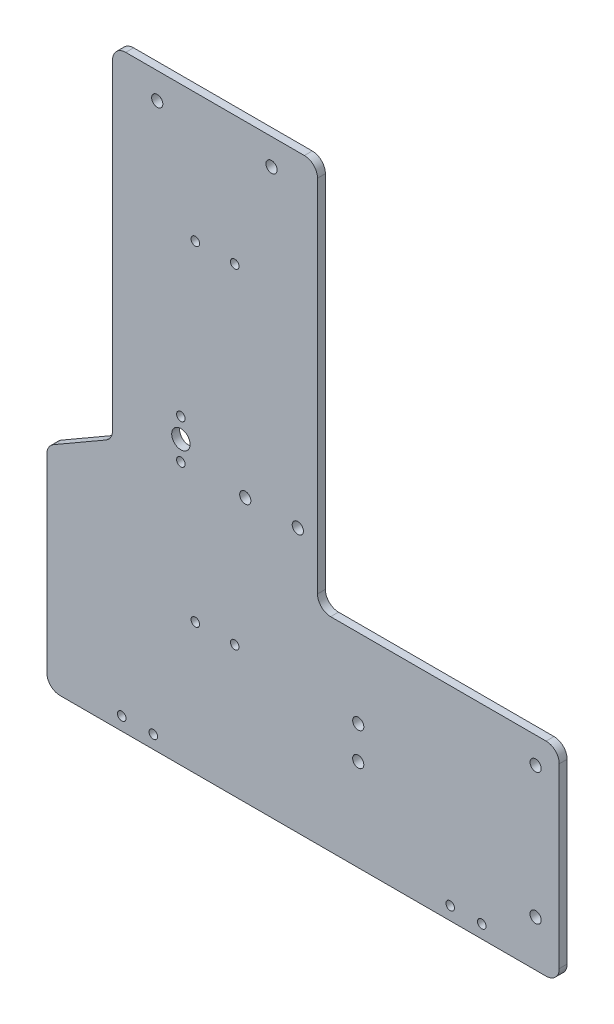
ISO-10303-21;
HEADER;
FILE_DESCRIPTION(('STEP AP214'),'2;1');
FILE_NAME('part.step','',(''),(''),'','','');
FILE_SCHEMA(('AUTOMOTIVE_DESIGN { 1 0 10303 214 1 1 1 1 }'));
ENDSEC;
DATA;
#1=APPLICATION_CONTEXT('core data for automotive mechanical design processes');
#2=APPLICATION_PROTOCOL_DEFINITION('international standard','automotive_design',2000,#1);
#3=PRODUCT_CONTEXT('',#1,'mechanical');
#4=PRODUCT('Part','Part','',(#3));
#5=PRODUCT_RELATED_PRODUCT_CATEGORY('part','',(#4));
#6=PRODUCT_DEFINITION_FORMATION('','',#4);
#7=PRODUCT_DEFINITION_CONTEXT('part definition',#1,'design');
#8=PRODUCT_DEFINITION('design','',#6,#7);
#9=PRODUCT_DEFINITION_SHAPE('','',#8);
#10=(LENGTH_UNIT() NAMED_UNIT(*) SI_UNIT(.MILLI.,.METRE.));
#11=(NAMED_UNIT(*) PLANE_ANGLE_UNIT() SI_UNIT($,.RADIAN.));
#12=(NAMED_UNIT(*) SI_UNIT($,.STERADIAN.) SOLID_ANGLE_UNIT());
#13=UNCERTAINTY_MEASURE_WITH_UNIT(LENGTH_MEASURE(1.E-05),#10,'distance_accuracy_value','');
#14=(GEOMETRIC_REPRESENTATION_CONTEXT(3) GLOBAL_UNCERTAINTY_ASSIGNED_CONTEXT((#13)) GLOBAL_UNIT_ASSIGNED_CONTEXT((#10,
#11,#12)) REPRESENTATION_CONTEXT('',''));
#15=CARTESIAN_POINT('',(0.,0.,0.));
#16=DIRECTION('',(0.,0.,1.));
#17=DIRECTION('',(1.,0.,0.));
#18=AXIS2_PLACEMENT_3D('',#15,#16,#17);
#19=CARTESIAN_POINT('',(-85.5227146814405,369.756925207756,6.00000000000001));
#20=DIRECTION('',(1.,0.,0.));
#21=DIRECTION('',(0.,1.,0.));
#22=AXIS2_PLACEMENT_3D('',#19,#20,#21);
#23=PLANE('',#22);
#24=DIRECTION('',(0.,-1.,0.));
#25=VECTOR('',#24,1.);
#26=CARTESIAN_POINT('',(-85.5227146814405,369.756925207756,6.00000000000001));
#27=LINE('',#26,#25);
#28=CARTESIAN_POINT('',(-85.5227146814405,74.9834225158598,6.00000000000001));
#29=VERTEX_POINT('',#28);
#30=CARTESIAN_POINT('',(-85.5227146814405,-69.2430747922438,6.00000000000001));
#31=VERTEX_POINT('',#30);
#32=EDGE_CURVE('E171',#29,#31,#27,.T.);
#33=ORIENTED_EDGE('',*,*,#32,.F.);
#34=DIRECTION('',(0.,0.,-1.));
#35=VECTOR('',#34,1.);
#36=CARTESIAN_POINT('',(-85.5227146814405,74.9834225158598,6.00000000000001));
#37=LINE('',#36,#35);
#38=CARTESIAN_POINT('',(-85.5227146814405,74.9834225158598,0.));
#39=VERTEX_POINT('',#38);
#40=EDGE_CURVE('E225',#29,#39,#37,.T.);
#41=ORIENTED_EDGE('',*,*,#40,.T.);
#42=DIRECTION('',(0.,-1.,0.));
#43=VECTOR('',#42,1.);
#44=CARTESIAN_POINT('',(-85.5227146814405,369.756925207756,0.));
#45=LINE('',#44,#43);
#46=CARTESIAN_POINT('',(-85.5227146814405,-69.2430747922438,0.));
#47=VERTEX_POINT('',#46);
#48=EDGE_CURVE('E173',#39,#47,#45,.T.);
#49=ORIENTED_EDGE('',*,*,#48,.T.);
#50=DIRECTION('',(0.,0.,-1.));
#51=VECTOR('',#50,1.);
#52=CARTESIAN_POINT('',(-85.5227146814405,-69.2430747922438,6.00000000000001));
#53=LINE('',#52,#51);
#54=EDGE_CURVE('E223',#47,#31,#53,.F.);
#55=ORIENTED_EDGE('',*,*,#54,.T.);
#56=EDGE_LOOP('',(#33,#41,#49,#55));
#57=FACE_BOUND('',#56,.T.);
#58=ADVANCED_FACE('F26',(#57),#23,.F.);
#59=CARTESIAN_POINT('',(-85.5227146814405,-79.2430747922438,6.00000000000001));
#60=DIRECTION('',(0.,1.,0.));
#61=DIRECTION('',(0.,0.,1.));
#62=AXIS2_PLACEMENT_3D('',#59,#60,#61);
#63=PLANE('',#62);
#64=DIRECTION('',(1.,0.,0.));
#65=VECTOR('',#64,1.);
#66=CARTESIAN_POINT('',(-85.5227146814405,-79.2430747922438,0.));
#67=LINE('',#66,#65);
#68=CARTESIAN_POINT('',(-75.5227146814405,-79.2430747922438,0.));
#69=VERTEX_POINT('',#68);
#70=CARTESIAN_POINT('',(294.47728531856,-79.2430747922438,0.));
#71=VERTEX_POINT('',#70);
#72=EDGE_CURVE('E168',#69,#71,#67,.T.);
#73=ORIENTED_EDGE('',*,*,#72,.T.);
#74=DIRECTION('',(0.,0.,-1.));
#75=VECTOR('',#74,1.);
#76=CARTESIAN_POINT('',(294.47728531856,-79.2430747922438,6.00000000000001));
#77=LINE('',#76,#75);
#78=CARTESIAN_POINT('',(294.47728531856,-79.2430747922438,6.00000000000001));
#79=VERTEX_POINT('',#78);
#80=EDGE_CURVE('E144',#71,#79,#77,.F.);
#81=ORIENTED_EDGE('',*,*,#80,.T.);
#82=DIRECTION('',(1.,0.,0.));
#83=VECTOR('',#82,1.);
#84=CARTESIAN_POINT('',(-85.5227146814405,-79.2430747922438,6.00000000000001));
#85=LINE('',#84,#83);
#86=CARTESIAN_POINT('',(-75.5227146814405,-79.2430747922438,6.00000000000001));
#87=VERTEX_POINT('',#86);
#88=EDGE_CURVE('E179',#87,#79,#85,.T.);
#89=ORIENTED_EDGE('',*,*,#88,.F.);
#90=DIRECTION('',(0.,0.,-1.));
#91=VECTOR('',#90,1.);
#92=CARTESIAN_POINT('',(-75.5227146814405,-79.2430747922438,6.00000000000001));
#93=LINE('',#92,#91);
#94=EDGE_CURVE('E149',#87,#69,#93,.T.);
#95=ORIENTED_EDGE('',*,*,#94,.T.);
#96=EDGE_LOOP('',(#73,#81,#89,#95));
#97=FACE_BOUND('',#96,.T.);
#98=ADVANCED_FACE('F453',(#97),#63,.F.);
#99=CARTESIAN_POINT('',(304.477285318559,369.756925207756,6.00000000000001));
#100=DIRECTION('',(-1.,0.,0.));
#101=DIRECTION('',(0.,-1.,0.));
#102=AXIS2_PLACEMENT_3D('',#99,#100,#101);
#103=PLANE('',#102);
#104=DIRECTION('',(0.,1.,0.));
#105=VECTOR('',#104,1.);
#106=CARTESIAN_POINT('',(304.477285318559,369.756925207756,6.00000000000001));
#107=LINE('',#106,#105);
#108=CARTESIAN_POINT('',(304.47728531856,-69.2430747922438,6.00000000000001));
#109=VERTEX_POINT('',#108);
#110=CARTESIAN_POINT('',(304.47728531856,65.7569252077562,6.00000000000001));
#111=VERTEX_POINT('',#110);
#112=EDGE_CURVE('E160',#109,#111,#107,.T.);
#113=ORIENTED_EDGE('',*,*,#112,.F.);
#114=DIRECTION('',(0.,0.,-1.));
#115=VECTOR('',#114,1.);
#116=CARTESIAN_POINT('',(304.47728531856,-69.2430747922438,6.00000000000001));
#117=LINE('',#116,#115);
#118=CARTESIAN_POINT('',(304.47728531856,-69.2430747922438,0.));
#119=VERTEX_POINT('',#118);
#120=EDGE_CURVE('E143',#109,#119,#117,.T.);
#121=ORIENTED_EDGE('',*,*,#120,.T.);
#122=DIRECTION('',(0.,1.,0.));
#123=VECTOR('',#122,1.);
#124=CARTESIAN_POINT('',(304.477285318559,369.756925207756,0.));
#125=LINE('',#124,#123);
#126=CARTESIAN_POINT('',(304.47728531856,65.7569252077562,0.));
#127=VERTEX_POINT('',#126);
#128=EDGE_CURVE('E157',#119,#127,#125,.T.);
#129=ORIENTED_EDGE('',*,*,#128,.T.);
#130=DIRECTION('',(0.,0.,1.));
#131=VECTOR('',#130,1.);
#132=CARTESIAN_POINT('',(304.47728531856,65.7569252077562,6.00000000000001));
#133=LINE('',#132,#131);
#134=EDGE_CURVE('E162',#127,#111,#133,.T.);
#135=ORIENTED_EDGE('',*,*,#134,.T.);
#136=EDGE_LOOP('',(#113,#121,#129,#135));
#137=FACE_BOUND('',#136,.T.);
#138=ADVANCED_FACE('F155',(#137),#103,.F.);
#139=CARTESIAN_POINT('',(-85.5227146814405,369.756925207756,6.00000000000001));
#140=DIRECTION('',(0.,-1.,0.));
#141=DIRECTION('',(0.,0.,-1.));
#142=AXIS2_PLACEMENT_3D('',#139,#140,#141);
#143=PLANE('',#142);
#144=DIRECTION('',(-1.,0.,0.));
#145=VECTOR('',#144,1.);
#146=CARTESIAN_POINT('',(-85.5227146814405,369.756925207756,6.00000000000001));
#147=LINE('',#146,#145);
#148=CARTESIAN_POINT('',(110.47728531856,369.756925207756,6.00000000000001));
#149=VERTEX_POINT('',#148);
#150=CARTESIAN_POINT('',(-25.5227146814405,369.756925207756,6.00000000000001));
#151=VERTEX_POINT('',#150);
#152=EDGE_CURVE('E183',#149,#151,#147,.T.);
#153=ORIENTED_EDGE('',*,*,#152,.F.);
#154=DIRECTION('',(0.,0.,1.));
#155=VECTOR('',#154,1.);
#156=CARTESIAN_POINT('',(110.47728531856,369.756925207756,6.00000000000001));
#157=LINE('',#156,#155);
#158=CARTESIAN_POINT('',(110.47728531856,369.756925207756,0.));
#159=VERTEX_POINT('',#158);
#160=EDGE_CURVE('E239',#149,#159,#157,.F.);
#161=ORIENTED_EDGE('',*,*,#160,.T.);
#162=DIRECTION('',(-1.,0.,0.));
#163=VECTOR('',#162,1.);
#164=CARTESIAN_POINT('',(-85.5227146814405,369.756925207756,0.));
#165=LINE('',#164,#163);
#166=CARTESIAN_POINT('',(-25.5227146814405,369.756925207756,0.));
#167=VERTEX_POINT('',#166);
#168=EDGE_CURVE('E167',#159,#167,#165,.T.);
#169=ORIENTED_EDGE('',*,*,#168,.T.);
#170=DIRECTION('',(0.,0.,1.));
#171=VECTOR('',#170,1.);
#172=CARTESIAN_POINT('',(-25.5227146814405,369.756925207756,6.00000000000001));
#173=LINE('',#172,#171);
#174=EDGE_CURVE('E237',#167,#151,#173,.T.);
#175=ORIENTED_EDGE('',*,*,#174,.T.);
#176=EDGE_LOOP('',(#153,#161,#169,#175));
#177=FACE_BOUND('',#176,.T.);
#178=ADVANCED_FACE('F397',(#177),#143,.F.);
#179=CARTESIAN_POINT('',(-85.5227146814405,-79.2430747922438,6.00000000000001));
#180=DIRECTION('',(0.,0.,1.));
#181=DIRECTION('',(1.,0.,0.));
#182=AXIS2_PLACEMENT_3D('',#179,#180,#181);
#183=PLANE('',#182);
#184=CARTESIAN_POINT('',(-28.5227146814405,-69.2430747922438,6.00000000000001));
#185=DIRECTION('',(0.,0.,1.));
#186=DIRECTION('',(1.,0.,0.));
#187=AXIS2_PLACEMENT_3D('',#184,#185,#186);
#188=CIRCLE('',#187,3.25);
#189=CARTESIAN_POINT('',(-25.2727146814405,-69.2430747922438,6.00000000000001));
#190=VERTEX_POINT('',#189);
#191=EDGE_CURVE('E389',#190,#190,#188,.T.);
#192=ORIENTED_EDGE('',*,*,#191,.F.);
#193=EDGE_LOOP('',(#192));
#194=FACE_BOUND('',#193,.T.);
#195=CARTESIAN_POINT('',(-4.5227146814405,-69.2430747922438,6.00000000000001));
#196=DIRECTION('',(0.,0.,1.));
#197=DIRECTION('',(1.,0.,0.));
#198=AXIS2_PLACEMENT_3D('',#195,#196,#197);
#199=CIRCLE('',#198,3.25);
#200=CARTESIAN_POINT('',(-1.27271468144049,-69.2430747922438,6.00000000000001));
#201=VERTEX_POINT('',#200);
#202=EDGE_CURVE('E383',#201,#201,#199,.T.);
#203=ORIENTED_EDGE('',*,*,#202,.F.);
#204=EDGE_LOOP('',(#203));
#205=FACE_BOUND('',#204,.T.);
#206=CARTESIAN_POINT('',(286.47728531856,55.7569252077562,6.00000000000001));
#207=DIRECTION('',(0.,0.,1.));
#208=DIRECTION('',(1.,0.,0.));
#209=AXIS2_PLACEMENT_3D('',#206,#207,#208);
#210=CIRCLE('',#209,4.24999999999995);
#211=CARTESIAN_POINT('',(290.727285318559,55.7569252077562,6.00000000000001));
#212=VERTEX_POINT('',#211);
#213=EDGE_CURVE('E377',#212,#212,#210,.T.);
#214=ORIENTED_EDGE('',*,*,#213,.F.);
#215=EDGE_LOOP('',(#214));
#216=FACE_BOUND('',#215,.T.);
#217=CARTESIAN_POINT('',(286.47728531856,-44.2430747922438,6.00000000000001));
#218=DIRECTION('',(0.,0.,1.));
#219=DIRECTION('',(1.,0.,0.));
#220=AXIS2_PLACEMENT_3D('',#217,#218,#219);
#221=CIRCLE('',#220,4.24999999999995);
#222=CARTESIAN_POINT('',(290.727285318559,-44.2430747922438,6.00000000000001));
#223=VERTEX_POINT('',#222);
#224=EDGE_CURVE('E371',#223,#223,#221,.T.);
#225=ORIENTED_EDGE('',*,*,#224,.F.);
#226=EDGE_LOOP('',(#225));
#227=FACE_BOUND('',#226,.T.);
#228=CARTESIAN_POINT('',(245.47728531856,-69.2430747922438,6.00000000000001));
#229=DIRECTION('',(0.,0.,1.));
#230=DIRECTION('',(1.,0.,0.));
#231=AXIS2_PLACEMENT_3D('',#228,#229,#230);
#232=CIRCLE('',#231,3.25000000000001);
#233=CARTESIAN_POINT('',(248.72728531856,-69.2430747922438,6.00000000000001));
#234=VERTEX_POINT('',#233);
#235=EDGE_CURVE('E365',#234,#234,#232,.T.);
#236=ORIENTED_EDGE('',*,*,#235,.F.);
#237=EDGE_LOOP('',(#236));
#238=FACE_BOUND('',#237,.T.);
#239=CARTESIAN_POINT('',(221.47728531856,-69.2430747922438,6.00000000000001));
#240=DIRECTION('',(0.,0.,1.));
#241=DIRECTION('',(1.,0.,0.));
#242=AXIS2_PLACEMENT_3D('',#239,#240,#241);
#243=CIRCLE('',#242,3.25000000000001);
#244=CARTESIAN_POINT('',(224.72728531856,-69.2430747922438,6.00000000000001));
#245=VERTEX_POINT('',#244);
#246=EDGE_CURVE('E359',#245,#245,#243,.T.);
#247=ORIENTED_EDGE('',*,*,#246,.F.);
#248=EDGE_LOOP('',(#247));
#249=FACE_BOUND('',#248,.T.);
#250=CARTESIAN_POINT('',(151.47728531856,-9.24307479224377,6.00000000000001));
#251=DIRECTION('',(0.,0.,1.));
#252=DIRECTION('',(1.,0.,0.));
#253=AXIS2_PLACEMENT_3D('',#250,#251,#252);
#254=CIRCLE('',#253,4.25000000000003);
#255=CARTESIAN_POINT('',(155.72728531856,-9.24307479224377,6.00000000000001));
#256=VERTEX_POINT('',#255);
#257=EDGE_CURVE('E353',#256,#256,#254,.T.);
#258=ORIENTED_EDGE('',*,*,#257,.F.);
#259=EDGE_LOOP('',(#258));
#260=FACE_BOUND('',#259,.T.);
#261=CARTESIAN_POINT('',(151.47728531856,15.7569252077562,6.00000000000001));
#262=DIRECTION('',(0.,0.,1.));
#263=DIRECTION('',(1.,0.,0.));
#264=AXIS2_PLACEMENT_3D('',#261,#262,#263);
#265=CIRCLE('',#264,4.25000000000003);
#266=CARTESIAN_POINT('',(155.72728531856,15.7569252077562,6.00000000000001));
#267=VERTEX_POINT('',#266);
#268=EDGE_CURVE('E347',#267,#267,#265,.T.);
#269=ORIENTED_EDGE('',*,*,#268,.F.);
#270=EDGE_LOOP('',(#269));
#271=FACE_BOUND('',#270,.T.);
#272=CARTESIAN_POINT('',(57.4772853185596,20.7569252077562,6.00000000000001));
#273=DIRECTION('',(0.,0.,1.));
#274=DIRECTION('',(1.,0.,0.));
#275=AXIS2_PLACEMENT_3D('',#272,#273,#274);
#276=CIRCLE('',#275,3.25);
#277=CARTESIAN_POINT('',(60.7272853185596,20.7569252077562,6.00000000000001));
#278=VERTEX_POINT('',#277);
#279=EDGE_CURVE('E341',#278,#278,#276,.T.);
#280=ORIENTED_EDGE('',*,*,#279,.F.);
#281=EDGE_LOOP('',(#280));
#282=FACE_BOUND('',#281,.T.);
#283=CARTESIAN_POINT('',(27.4772853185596,20.7569252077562,6.00000000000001));
#284=DIRECTION('',(0.,0.,1.));
#285=DIRECTION('',(1.,0.,0.));
#286=AXIS2_PLACEMENT_3D('',#283,#284,#285);
#287=CIRCLE('',#286,3.25);
#288=CARTESIAN_POINT('',(30.7272853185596,20.7569252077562,6.00000000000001));
#289=VERTEX_POINT('',#288);
#290=EDGE_CURVE('E335',#289,#289,#287,.T.);
#291=ORIENTED_EDGE('',*,*,#290,.F.);
#292=EDGE_LOOP('',(#291));
#293=FACE_BOUND('',#292,.T.);
#294=CARTESIAN_POINT('',(105.47728531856,121.756925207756,6.00000000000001));
#295=DIRECTION('',(0.,0.,1.));
#296=DIRECTION('',(1.,0.,0.));
#297=AXIS2_PLACEMENT_3D('',#294,#295,#296);
#298=CIRCLE('',#297,4.25000000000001);
#299=CARTESIAN_POINT('',(109.72728531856,121.756925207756,6.00000000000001));
#300=VERTEX_POINT('',#299);
#301=EDGE_CURVE('E329',#300,#300,#298,.T.);
#302=ORIENTED_EDGE('',*,*,#301,.F.);
#303=EDGE_LOOP('',(#302));
#304=FACE_BOUND('',#303,.T.);
#305=CARTESIAN_POINT('',(65.4772853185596,121.756925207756,6.00000000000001));
#306=DIRECTION('',(0.,0.,1.));
#307=DIRECTION('',(1.,0.,0.));
#308=AXIS2_PLACEMENT_3D('',#305,#306,#307);
#309=CIRCLE('',#308,4.25000000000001);
#310=CARTESIAN_POINT('',(69.7272853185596,121.756925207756,6.00000000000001));
#311=VERTEX_POINT('',#310);
#312=EDGE_CURVE('E323',#311,#311,#309,.T.);
#313=ORIENTED_EDGE('',*,*,#312,.F.);
#314=EDGE_LOOP('',(#313));
#315=FACE_BOUND('',#314,.T.);
#316=CARTESIAN_POINT('',(16.4772853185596,120.756925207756,6.00000000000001));
#317=DIRECTION('',(0.,0.,1.));
#318=DIRECTION('',(1.,0.,0.));
#319=AXIS2_PLACEMENT_3D('',#316,#317,#318);
#320=CIRCLE('',#319,3.25);
#321=CARTESIAN_POINT('',(19.7272853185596,120.756925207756,6.00000000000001));
#322=VERTEX_POINT('',#321);
#323=EDGE_CURVE('E317',#322,#322,#320,.T.);
#324=ORIENTED_EDGE('',*,*,#323,.F.);
#325=EDGE_LOOP('',(#324));
#326=FACE_BOUND('',#325,.T.);
#327=CARTESIAN_POINT('',(16.4772853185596,135.756925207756,6.00000000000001));
#328=DIRECTION('',(0.,0.,1.));
#329=DIRECTION('',(1.,0.,0.));
#330=AXIS2_PLACEMENT_3D('',#327,#328,#329);
#331=CIRCLE('',#330,7.00000000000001);
#332=CARTESIAN_POINT('',(23.4772853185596,135.756925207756,6.00000000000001));
#333=VERTEX_POINT('',#332);
#334=EDGE_CURVE('E311',#333,#333,#331,.T.);
#335=ORIENTED_EDGE('',*,*,#334,.F.);
#336=EDGE_LOOP('',(#335));
#337=FACE_BOUND('',#336,.T.);
#338=CARTESIAN_POINT('',(16.4772853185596,150.756925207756,6.00000000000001));
#339=DIRECTION('',(0.,0.,1.));
#340=DIRECTION('',(1.,0.,0.));
#341=AXIS2_PLACEMENT_3D('',#338,#339,#340);
#342=CIRCLE('',#341,3.25);
#343=CARTESIAN_POINT('',(19.7272853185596,150.756925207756,6.00000000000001));
#344=VERTEX_POINT('',#343);
#345=EDGE_CURVE('E305',#344,#344,#342,.T.);
#346=ORIENTED_EDGE('',*,*,#345,.F.);
#347=EDGE_LOOP('',(#346));
#348=FACE_BOUND('',#347,.T.);
#349=CARTESIAN_POINT('',(57.4772853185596,271.756925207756,6.00000000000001));
#350=DIRECTION('',(0.,0.,1.));
#351=DIRECTION('',(1.,0.,0.));
#352=AXIS2_PLACEMENT_3D('',#349,#350,#351);
#353=CIRCLE('',#352,3.25000000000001);
#354=CARTESIAN_POINT('',(60.7272853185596,271.756925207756,6.00000000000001));
#355=VERTEX_POINT('',#354);
#356=EDGE_CURVE('E299',#355,#355,#353,.T.);
#357=ORIENTED_EDGE('',*,*,#356,.F.);
#358=EDGE_LOOP('',(#357));
#359=FACE_BOUND('',#358,.T.);
#360=CARTESIAN_POINT('',(27.4772853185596,271.756925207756,6.00000000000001));
#361=DIRECTION('',(0.,0.,1.));
#362=DIRECTION('',(1.,0.,0.));
#363=AXIS2_PLACEMENT_3D('',#360,#361,#362);
#364=CIRCLE('',#363,3.25);
#365=CARTESIAN_POINT('',(30.7272853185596,271.756925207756,6.00000000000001));
#366=VERTEX_POINT('',#365);
#367=EDGE_CURVE('E293',#366,#366,#364,.T.);
#368=ORIENTED_EDGE('',*,*,#367,.F.);
#369=EDGE_LOOP('',(#368));
#370=FACE_BOUND('',#369,.T.);
#371=CARTESIAN_POINT('',(85.4772853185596,349.756925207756,6.00000000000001));
#372=DIRECTION('',(0.,0.,1.));
#373=DIRECTION('',(1.,0.,0.));
#374=AXIS2_PLACEMENT_3D('',#371,#372,#373);
#375=CIRCLE('',#374,4.25000000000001);
#376=CARTESIAN_POINT('',(89.7272853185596,349.756925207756,6.00000000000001));
#377=VERTEX_POINT('',#376);
#378=EDGE_CURVE('E287',#377,#377,#375,.T.);
#379=ORIENTED_EDGE('',*,*,#378,.F.);
#380=EDGE_LOOP('',(#379));
#381=FACE_BOUND('',#380,.T.);
#382=CARTESIAN_POINT('',(-1.52271468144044,349.756925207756,6.00000000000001));
#383=DIRECTION('',(0.,0.,1.));
#384=DIRECTION('',(1.,0.,0.));
#385=AXIS2_PLACEMENT_3D('',#382,#383,#384);
#386=CIRCLE('',#385,4.25);
#387=CARTESIAN_POINT('',(2.72728531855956,349.756925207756,6.00000000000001));
#388=VERTEX_POINT('',#387);
#389=EDGE_CURVE('E281',#388,#388,#386,.T.);
#390=ORIENTED_EDGE('',*,*,#389,.F.);
#391=EDGE_LOOP('',(#390));
#392=FACE_BOUND('',#391,.T.);
#393=ORIENTED_EDGE('',*,*,#88,.T.);
#394=CARTESIAN_POINT('',(294.47728531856,-69.2430747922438,6.00000000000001));
#395=DIRECTION('',(0.,0.,1.));
#396=DIRECTION('',(1.,0.,0.));
#397=AXIS2_PLACEMENT_3D('',#394,#395,#396);
#398=CIRCLE('',#397,10.);
#399=EDGE_CURVE('E211',#79,#109,#398,.T.);
#400=ORIENTED_EDGE('',*,*,#399,.T.);
#401=ORIENTED_EDGE('',*,*,#112,.T.);
#402=CARTESIAN_POINT('',(294.47728531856,65.7569252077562,6.00000000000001));
#403=DIRECTION('',(0.,0.,1.));
#404=DIRECTION('',(1.,0.,0.));
#405=AXIS2_PLACEMENT_3D('',#402,#403,#404);
#406=CIRCLE('',#405,10.);
#407=CARTESIAN_POINT('',(294.47728531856,75.7569252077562,6.00000000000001));
#408=VERTEX_POINT('',#407);
#409=EDGE_CURVE('E209',#111,#408,#406,.T.);
#410=ORIENTED_EDGE('',*,*,#409,.T.);
#411=DIRECTION('',(1.,0.,0.));
#412=VECTOR('',#411,1.);
#413=CARTESIAN_POINT('',(120.47728531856,75.7569252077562,6.00000000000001));
#414=LINE('',#413,#412);
#415=CARTESIAN_POINT('',(130.47728531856,75.7569252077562,6.00000000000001));
#416=VERTEX_POINT('',#415);
#417=EDGE_CURVE('E249',#416,#408,#414,.T.);
#418=ORIENTED_EDGE('',*,*,#417,.F.);
#419=CARTESIAN_POINT('',(130.47728531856,85.7569252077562,6.00000000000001));
#420=DIRECTION('',(0.,0.,1.));
#421=DIRECTION('',(1.,0.,0.));
#422=AXIS2_PLACEMENT_3D('',#419,#420,#421);
#423=CIRCLE('',#422,10.);
#424=CARTESIAN_POINT('',(120.47728531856,85.7569252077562,6.00000000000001));
#425=VERTEX_POINT('',#424);
#426=EDGE_CURVE('E33',#416,#425,#423,.F.);
#427=ORIENTED_EDGE('',*,*,#426,.T.);
#428=DIRECTION('',(0.,-1.,0.));
#429=VECTOR('',#428,1.);
#430=CARTESIAN_POINT('',(120.47728531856,369.756925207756,6.00000000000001));
#431=LINE('',#430,#429);
#432=CARTESIAN_POINT('',(120.47728531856,359.756925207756,6.00000000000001));
#433=VERTEX_POINT('',#432);
#434=EDGE_CURVE('E247',#433,#425,#431,.T.);
#435=ORIENTED_EDGE('',*,*,#434,.F.);
#436=CARTESIAN_POINT('',(110.47728531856,359.756925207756,6.00000000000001));
#437=DIRECTION('',(0.,0.,1.));
#438=DIRECTION('',(1.,0.,0.));
#439=AXIS2_PLACEMENT_3D('',#436,#437,#438);
#440=CIRCLE('',#439,10.);
#441=EDGE_CURVE('E48',#433,#149,#440,.T.);
#442=ORIENTED_EDGE('',*,*,#441,.T.);
#443=ORIENTED_EDGE('',*,*,#152,.T.);
#444=CARTESIAN_POINT('',(-25.5227146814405,359.756925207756,6.00000000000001));
#445=DIRECTION('',(0.,0.,1.));
#446=DIRECTION('',(1.,0.,0.));
#447=AXIS2_PLACEMENT_3D('',#444,#445,#446);
#448=CIRCLE('',#447,10.);
#449=CARTESIAN_POINT('',(-35.5227146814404,359.756925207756,6.00000000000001));
#450=VERTEX_POINT('',#449);
#451=EDGE_CURVE('E40',#151,#450,#448,.T.);
#452=ORIENTED_EDGE('',*,*,#451,.T.);
#453=DIRECTION('',(0.,1.,0.));
#454=VECTOR('',#453,1.);
#455=CARTESIAN_POINT('',(-35.5227146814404,369.756925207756,6.00000000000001));
#456=LINE('',#455,#454);
#457=CARTESIAN_POINT('',(-35.5227146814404,115.397941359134,6.00000000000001));
#458=VERTEX_POINT('',#457);
#459=EDGE_CURVE('E275',#458,#450,#456,.T.);
#460=ORIENTED_EDGE('',*,*,#459,.F.);
#461=CARTESIAN_POINT('',(-45.5227146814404,115.397941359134,6.00000000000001));
#462=DIRECTION('',(0.,0.,1.));
#463=DIRECTION('',(1.,0.,0.));
#464=AXIS2_PLACEMENT_3D('',#461,#462,#463);
#465=CIRCLE('',#464,10.);
#466=CARTESIAN_POINT('',(-40.5227146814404,106.73768732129,6.00000000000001));
#467=VERTEX_POINT('',#466);
#468=EDGE_CURVE('E241',#458,#467,#465,.F.);
#469=ORIENTED_EDGE('',*,*,#468,.T.);
#470=DIRECTION('',(0.866025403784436,0.500000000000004,0.));
#471=VECTOR('',#470,1.);
#472=CARTESIAN_POINT('',(-35.5227146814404,109.624438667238,6.00000000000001));
#473=LINE('',#472,#471);
#474=CARTESIAN_POINT('',(-80.5227146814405,83.6436765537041,6.00000000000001));
#475=VERTEX_POINT('',#474);
#476=EDGE_CURVE('E185',#467,#475,#473,.F.);
#477=ORIENTED_EDGE('',*,*,#476,.T.);
#478=CARTESIAN_POINT('',(-75.5227146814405,74.9834225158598,6.00000000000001));
#479=DIRECTION('',(0.,0.,1.));
#480=DIRECTION('',(1.,0.,0.));
#481=AXIS2_PLACEMENT_3D('',#478,#479,#480);
#482=CIRCLE('',#481,10.);
#483=EDGE_CURVE('E207',#475,#29,#482,.T.);
#484=ORIENTED_EDGE('',*,*,#483,.T.);
#485=ORIENTED_EDGE('',*,*,#32,.T.);
#486=CARTESIAN_POINT('',(-75.5227146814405,-69.2430747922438,6.00000000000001));
#487=DIRECTION('',(0.,0.,1.));
#488=DIRECTION('',(1.,0.,0.));
#489=AXIS2_PLACEMENT_3D('',#486,#487,#488);
#490=CIRCLE('',#489,10.);
#491=EDGE_CURVE('E203',#31,#87,#490,.T.);
#492=ORIENTED_EDGE('',*,*,#491,.T.);
#493=EDGE_LOOP('',(#393,#400,#401,#410,#418,#427,#435,#442,#443,#452,#460,#469,#477,#484,#485,#492));
#494=FACE_BOUND('',#493,.T.);
#495=ADVANCED_FACE('F246',(#194,#205,#216,#227,#238,#249,#260,#271,#282,#293,#304,#315,#326,
#337,#348,#359,#370,#381,#392,#494),#183,.T.);
#496=CARTESIAN_POINT('',(-85.5227146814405,-79.2430747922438,0.));
#497=DIRECTION('',(0.,0.,1.));
#498=DIRECTION('',(1.,0.,0.));
#499=AXIS2_PLACEMENT_3D('',#496,#497,#498);
#500=PLANE('',#499);
#501=CARTESIAN_POINT('',(-28.5227146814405,-69.2430747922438,0.));
#502=DIRECTION('',(0.,0.,1.));
#503=DIRECTION('',(1.,0.,0.));
#504=AXIS2_PLACEMENT_3D('',#501,#502,#503);
#505=CIRCLE('',#504,3.25);
#506=CARTESIAN_POINT('',(-25.2727146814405,-69.2430747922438,0.));
#507=VERTEX_POINT('',#506);
#508=EDGE_CURVE('E386',#507,#507,#505,.T.);
#509=ORIENTED_EDGE('',*,*,#508,.T.);
#510=EDGE_LOOP('',(#509));
#511=FACE_BOUND('',#510,.T.);
#512=CARTESIAN_POINT('',(-4.5227146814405,-69.2430747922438,0.));
#513=DIRECTION('',(0.,0.,1.));
#514=DIRECTION('',(1.,0.,0.));
#515=AXIS2_PLACEMENT_3D('',#512,#513,#514);
#516=CIRCLE('',#515,3.25);
#517=CARTESIAN_POINT('',(-1.27271468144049,-69.2430747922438,0.));
#518=VERTEX_POINT('',#517);
#519=EDGE_CURVE('E380',#518,#518,#516,.T.);
#520=ORIENTED_EDGE('',*,*,#519,.T.);
#521=EDGE_LOOP('',(#520));
#522=FACE_BOUND('',#521,.T.);
#523=CARTESIAN_POINT('',(286.47728531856,55.7569252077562,0.));
#524=DIRECTION('',(0.,0.,1.));
#525=DIRECTION('',(1.,0.,0.));
#526=AXIS2_PLACEMENT_3D('',#523,#524,#525);
#527=CIRCLE('',#526,4.24999999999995);
#528=CARTESIAN_POINT('',(290.727285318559,55.7569252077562,0.));
#529=VERTEX_POINT('',#528);
#530=EDGE_CURVE('E374',#529,#529,#527,.T.);
#531=ORIENTED_EDGE('',*,*,#530,.T.);
#532=EDGE_LOOP('',(#531));
#533=FACE_BOUND('',#532,.T.);
#534=CARTESIAN_POINT('',(286.47728531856,-44.2430747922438,0.));
#535=DIRECTION('',(0.,0.,1.));
#536=DIRECTION('',(1.,0.,0.));
#537=AXIS2_PLACEMENT_3D('',#534,#535,#536);
#538=CIRCLE('',#537,4.24999999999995);
#539=CARTESIAN_POINT('',(290.727285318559,-44.2430747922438,0.));
#540=VERTEX_POINT('',#539);
#541=EDGE_CURVE('E368',#540,#540,#538,.T.);
#542=ORIENTED_EDGE('',*,*,#541,.T.);
#543=EDGE_LOOP('',(#542));
#544=FACE_BOUND('',#543,.T.);
#545=CARTESIAN_POINT('',(245.47728531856,-69.2430747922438,0.));
#546=DIRECTION('',(0.,0.,1.));
#547=DIRECTION('',(1.,0.,0.));
#548=AXIS2_PLACEMENT_3D('',#545,#546,#547);
#549=CIRCLE('',#548,3.25000000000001);
#550=CARTESIAN_POINT('',(248.72728531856,-69.2430747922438,0.));
#551=VERTEX_POINT('',#550);
#552=EDGE_CURVE('E362',#551,#551,#549,.T.);
#553=ORIENTED_EDGE('',*,*,#552,.T.);
#554=EDGE_LOOP('',(#553));
#555=FACE_BOUND('',#554,.T.);
#556=CARTESIAN_POINT('',(221.47728531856,-69.2430747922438,0.));
#557=DIRECTION('',(0.,0.,1.));
#558=DIRECTION('',(1.,0.,0.));
#559=AXIS2_PLACEMENT_3D('',#556,#557,#558);
#560=CIRCLE('',#559,3.25000000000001);
#561=CARTESIAN_POINT('',(224.72728531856,-69.2430747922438,0.));
#562=VERTEX_POINT('',#561);
#563=EDGE_CURVE('E356',#562,#562,#560,.T.);
#564=ORIENTED_EDGE('',*,*,#563,.T.);
#565=EDGE_LOOP('',(#564));
#566=FACE_BOUND('',#565,.T.);
#567=CARTESIAN_POINT('',(151.47728531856,-9.24307479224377,0.));
#568=DIRECTION('',(0.,0.,1.));
#569=DIRECTION('',(1.,0.,0.));
#570=AXIS2_PLACEMENT_3D('',#567,#568,#569);
#571=CIRCLE('',#570,4.25000000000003);
#572=CARTESIAN_POINT('',(155.72728531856,-9.24307479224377,0.));
#573=VERTEX_POINT('',#572);
#574=EDGE_CURVE('E350',#573,#573,#571,.T.);
#575=ORIENTED_EDGE('',*,*,#574,.T.);
#576=EDGE_LOOP('',(#575));
#577=FACE_BOUND('',#576,.T.);
#578=CARTESIAN_POINT('',(151.47728531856,15.7569252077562,0.));
#579=DIRECTION('',(0.,0.,1.));
#580=DIRECTION('',(1.,0.,0.));
#581=AXIS2_PLACEMENT_3D('',#578,#579,#580);
#582=CIRCLE('',#581,4.25000000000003);
#583=CARTESIAN_POINT('',(155.72728531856,15.7569252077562,0.));
#584=VERTEX_POINT('',#583);
#585=EDGE_CURVE('E344',#584,#584,#582,.T.);
#586=ORIENTED_EDGE('',*,*,#585,.T.);
#587=EDGE_LOOP('',(#586));
#588=FACE_BOUND('',#587,.T.);
#589=CARTESIAN_POINT('',(57.4772853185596,20.7569252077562,0.));
#590=DIRECTION('',(0.,0.,1.));
#591=DIRECTION('',(1.,0.,0.));
#592=AXIS2_PLACEMENT_3D('',#589,#590,#591);
#593=CIRCLE('',#592,3.25);
#594=CARTESIAN_POINT('',(60.7272853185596,20.7569252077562,0.));
#595=VERTEX_POINT('',#594);
#596=EDGE_CURVE('E338',#595,#595,#593,.T.);
#597=ORIENTED_EDGE('',*,*,#596,.T.);
#598=EDGE_LOOP('',(#597));
#599=FACE_BOUND('',#598,.T.);
#600=CARTESIAN_POINT('',(27.4772853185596,20.7569252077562,0.));
#601=DIRECTION('',(0.,0.,1.));
#602=DIRECTION('',(1.,0.,0.));
#603=AXIS2_PLACEMENT_3D('',#600,#601,#602);
#604=CIRCLE('',#603,3.25);
#605=CARTESIAN_POINT('',(30.7272853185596,20.7569252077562,0.));
#606=VERTEX_POINT('',#605);
#607=EDGE_CURVE('E332',#606,#606,#604,.T.);
#608=ORIENTED_EDGE('',*,*,#607,.T.);
#609=EDGE_LOOP('',(#608));
#610=FACE_BOUND('',#609,.T.);
#611=CARTESIAN_POINT('',(105.47728531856,121.756925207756,0.));
#612=DIRECTION('',(0.,0.,1.));
#613=DIRECTION('',(1.,0.,0.));
#614=AXIS2_PLACEMENT_3D('',#611,#612,#613);
#615=CIRCLE('',#614,4.25000000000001);
#616=CARTESIAN_POINT('',(109.72728531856,121.756925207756,0.));
#617=VERTEX_POINT('',#616);
#618=EDGE_CURVE('E326',#617,#617,#615,.T.);
#619=ORIENTED_EDGE('',*,*,#618,.T.);
#620=EDGE_LOOP('',(#619));
#621=FACE_BOUND('',#620,.T.);
#622=CARTESIAN_POINT('',(65.4772853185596,121.756925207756,0.));
#623=DIRECTION('',(0.,0.,1.));
#624=DIRECTION('',(1.,0.,0.));
#625=AXIS2_PLACEMENT_3D('',#622,#623,#624);
#626=CIRCLE('',#625,4.25000000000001);
#627=CARTESIAN_POINT('',(69.7272853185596,121.756925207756,0.));
#628=VERTEX_POINT('',#627);
#629=EDGE_CURVE('E320',#628,#628,#626,.T.);
#630=ORIENTED_EDGE('',*,*,#629,.T.);
#631=EDGE_LOOP('',(#630));
#632=FACE_BOUND('',#631,.T.);
#633=CARTESIAN_POINT('',(16.4772853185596,120.756925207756,0.));
#634=DIRECTION('',(0.,0.,1.));
#635=DIRECTION('',(1.,0.,0.));
#636=AXIS2_PLACEMENT_3D('',#633,#634,#635);
#637=CIRCLE('',#636,3.25);
#638=CARTESIAN_POINT('',(19.7272853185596,120.756925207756,0.));
#639=VERTEX_POINT('',#638);
#640=EDGE_CURVE('E314',#639,#639,#637,.T.);
#641=ORIENTED_EDGE('',*,*,#640,.T.);
#642=EDGE_LOOP('',(#641));
#643=FACE_BOUND('',#642,.T.);
#644=CARTESIAN_POINT('',(16.4772853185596,135.756925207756,0.));
#645=DIRECTION('',(0.,0.,1.));
#646=DIRECTION('',(1.,0.,0.));
#647=AXIS2_PLACEMENT_3D('',#644,#645,#646);
#648=CIRCLE('',#647,7.00000000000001);
#649=CARTESIAN_POINT('',(23.4772853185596,135.756925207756,0.));
#650=VERTEX_POINT('',#649);
#651=EDGE_CURVE('E308',#650,#650,#648,.T.);
#652=ORIENTED_EDGE('',*,*,#651,.T.);
#653=EDGE_LOOP('',(#652));
#654=FACE_BOUND('',#653,.T.);
#655=CARTESIAN_POINT('',(16.4772853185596,150.756925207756,0.));
#656=DIRECTION('',(0.,0.,1.));
#657=DIRECTION('',(1.,0.,0.));
#658=AXIS2_PLACEMENT_3D('',#655,#656,#657);
#659=CIRCLE('',#658,3.25);
#660=CARTESIAN_POINT('',(19.7272853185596,150.756925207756,0.));
#661=VERTEX_POINT('',#660);
#662=EDGE_CURVE('E302',#661,#661,#659,.T.);
#663=ORIENTED_EDGE('',*,*,#662,.T.);
#664=EDGE_LOOP('',(#663));
#665=FACE_BOUND('',#664,.T.);
#666=CARTESIAN_POINT('',(57.4772853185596,271.756925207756,0.));
#667=DIRECTION('',(0.,0.,1.));
#668=DIRECTION('',(1.,0.,0.));
#669=AXIS2_PLACEMENT_3D('',#666,#667,#668);
#670=CIRCLE('',#669,3.25000000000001);
#671=CARTESIAN_POINT('',(60.7272853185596,271.756925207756,0.));
#672=VERTEX_POINT('',#671);
#673=EDGE_CURVE('E296',#672,#672,#670,.T.);
#674=ORIENTED_EDGE('',*,*,#673,.T.);
#675=EDGE_LOOP('',(#674));
#676=FACE_BOUND('',#675,.T.);
#677=CARTESIAN_POINT('',(27.4772853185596,271.756925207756,0.));
#678=DIRECTION('',(0.,0.,1.));
#679=DIRECTION('',(1.,0.,0.));
#680=AXIS2_PLACEMENT_3D('',#677,#678,#679);
#681=CIRCLE('',#680,3.25);
#682=CARTESIAN_POINT('',(30.7272853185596,271.756925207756,0.));
#683=VERTEX_POINT('',#682);
#684=EDGE_CURVE('E290',#683,#683,#681,.T.);
#685=ORIENTED_EDGE('',*,*,#684,.T.);
#686=EDGE_LOOP('',(#685));
#687=FACE_BOUND('',#686,.T.);
#688=CARTESIAN_POINT('',(85.4772853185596,349.756925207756,0.));
#689=DIRECTION('',(0.,0.,1.));
#690=DIRECTION('',(1.,0.,0.));
#691=AXIS2_PLACEMENT_3D('',#688,#689,#690);
#692=CIRCLE('',#691,4.25000000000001);
#693=CARTESIAN_POINT('',(89.7272853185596,349.756925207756,0.));
#694=VERTEX_POINT('',#693);
#695=EDGE_CURVE('E284',#694,#694,#692,.T.);
#696=ORIENTED_EDGE('',*,*,#695,.T.);
#697=EDGE_LOOP('',(#696));
#698=FACE_BOUND('',#697,.T.);
#699=CARTESIAN_POINT('',(-1.52271468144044,349.756925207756,0.));
#700=DIRECTION('',(0.,0.,1.));
#701=DIRECTION('',(1.,0.,0.));
#702=AXIS2_PLACEMENT_3D('',#699,#700,#701);
#703=CIRCLE('',#702,4.25);
#704=CARTESIAN_POINT('',(2.72728531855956,349.756925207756,0.));
#705=VERTEX_POINT('',#704);
#706=EDGE_CURVE('E278',#705,#705,#703,.T.);
#707=ORIENTED_EDGE('',*,*,#706,.T.);
#708=EDGE_LOOP('',(#707));
#709=FACE_BOUND('',#708,.T.);
#710=ORIENTED_EDGE('',*,*,#128,.F.);
#711=CARTESIAN_POINT('',(294.47728531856,-69.2430747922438,0.));
#712=DIRECTION('',(0.,0.,1.));
#713=DIRECTION('',(1.,0.,0.));
#714=AXIS2_PLACEMENT_3D('',#711,#712,#713);
#715=CIRCLE('',#714,10.);
#716=EDGE_CURVE('E139',#119,#71,#715,.F.);
#717=ORIENTED_EDGE('',*,*,#716,.T.);
#718=ORIENTED_EDGE('',*,*,#72,.F.);
#719=CARTESIAN_POINT('',(-75.5227146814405,-69.2430747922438,0.));
#720=DIRECTION('',(0.,0.,1.));
#721=DIRECTION('',(1.,0.,0.));
#722=AXIS2_PLACEMENT_3D('',#719,#720,#721);
#723=CIRCLE('',#722,10.);
#724=EDGE_CURVE('E161',#69,#47,#723,.F.);
#725=ORIENTED_EDGE('',*,*,#724,.T.);
#726=ORIENTED_EDGE('',*,*,#48,.F.);
#727=CARTESIAN_POINT('',(-75.5227146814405,74.9834225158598,0.));
#728=DIRECTION('',(0.,0.,1.));
#729=DIRECTION('',(1.,0.,0.));
#730=AXIS2_PLACEMENT_3D('',#727,#728,#729);
#731=CIRCLE('',#730,10.);
#732=CARTESIAN_POINT('',(-80.5227146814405,83.6436765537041,0.));
#733=VERTEX_POINT('',#732);
#734=EDGE_CURVE('E197',#39,#733,#731,.F.);
#735=ORIENTED_EDGE('',*,*,#734,.T.);
#736=DIRECTION('',(-0.866025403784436,-0.500000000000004,0.));
#737=VECTOR('',#736,1.);
#738=CARTESIAN_POINT('',(-154.804746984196,40.7569252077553,0.));
#739=LINE('',#738,#737);
#740=CARTESIAN_POINT('',(-40.5227146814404,106.737687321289,0.));
#741=VERTEX_POINT('',#740);
#742=EDGE_CURVE('E188',#733,#741,#739,.F.);
#743=ORIENTED_EDGE('',*,*,#742,.T.);
#744=CARTESIAN_POINT('',(-45.5227146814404,115.397941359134,0.));
#745=DIRECTION('',(0.,0.,1.));
#746=DIRECTION('',(1.,0.,0.));
#747=AXIS2_PLACEMENT_3D('',#744,#745,#746);
#748=CIRCLE('',#747,10.);
#749=CARTESIAN_POINT('',(-35.5227146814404,115.397941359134,0.));
#750=VERTEX_POINT('',#749);
#751=EDGE_CURVE('E243',#741,#750,#748,.T.);
#752=ORIENTED_EDGE('',*,*,#751,.T.);
#753=DIRECTION('',(0.,1.,0.));
#754=VECTOR('',#753,1.);
#755=CARTESIAN_POINT('',(-35.5227146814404,369.756925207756,0.));
#756=LINE('',#755,#754);
#757=CARTESIAN_POINT('',(-35.5227146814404,359.756925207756,0.));
#758=VERTEX_POINT('',#757);
#759=EDGE_CURVE('E258',#750,#758,#756,.T.);
#760=ORIENTED_EDGE('',*,*,#759,.T.);
#761=CARTESIAN_POINT('',(-25.5227146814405,359.756925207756,0.));
#762=DIRECTION('',(0.,0.,1.));
#763=DIRECTION('',(1.,0.,0.));
#764=AXIS2_PLACEMENT_3D('',#761,#762,#763);
#765=CIRCLE('',#764,10.);
#766=EDGE_CURVE('E193',#758,#167,#765,.F.);
#767=ORIENTED_EDGE('',*,*,#766,.T.);
#768=ORIENTED_EDGE('',*,*,#168,.F.);
#769=CARTESIAN_POINT('',(110.47728531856,359.756925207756,0.));
#770=DIRECTION('',(0.,0.,1.));
#771=DIRECTION('',(1.,0.,0.));
#772=AXIS2_PLACEMENT_3D('',#769,#770,#771);
#773=CIRCLE('',#772,10.);
#774=CARTESIAN_POINT('',(120.47728531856,359.756925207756,0.));
#775=VERTEX_POINT('',#774);
#776=EDGE_CURVE('E195',#159,#775,#773,.F.);
#777=ORIENTED_EDGE('',*,*,#776,.T.);
#778=DIRECTION('',(0.,-1.,0.));
#779=VECTOR('',#778,1.);
#780=CARTESIAN_POINT('',(120.47728531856,369.756925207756,0.));
#781=LINE('',#780,#779);
#782=CARTESIAN_POINT('',(120.47728531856,85.7569252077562,0.));
#783=VERTEX_POINT('',#782);
#784=EDGE_CURVE('E264',#775,#783,#781,.T.);
#785=ORIENTED_EDGE('',*,*,#784,.T.);
#786=CARTESIAN_POINT('',(130.47728531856,85.7569252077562,0.));
#787=DIRECTION('',(0.,0.,1.));
#788=DIRECTION('',(1.,0.,0.));
#789=AXIS2_PLACEMENT_3D('',#786,#787,#788);
#790=CIRCLE('',#789,10.);
#791=CARTESIAN_POINT('',(130.47728531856,75.7569252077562,0.));
#792=VERTEX_POINT('',#791);
#793=EDGE_CURVE('E11',#783,#792,#790,.T.);
#794=ORIENTED_EDGE('',*,*,#793,.T.);
#795=DIRECTION('',(1.,0.,0.));
#796=VECTOR('',#795,1.);
#797=CARTESIAN_POINT('',(120.47728531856,75.7569252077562,0.));
#798=LINE('',#797,#796);
#799=CARTESIAN_POINT('',(294.47728531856,75.7569252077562,0.));
#800=VERTEX_POINT('',#799);
#801=EDGE_CURVE('E263',#792,#800,#798,.T.);
#802=ORIENTED_EDGE('',*,*,#801,.T.);
#803=CARTESIAN_POINT('',(294.47728531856,65.7569252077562,0.));
#804=DIRECTION('',(0.,0.,1.));
#805=DIRECTION('',(1.,0.,0.));
#806=AXIS2_PLACEMENT_3D('',#803,#804,#805);
#807=CIRCLE('',#806,10.);
#808=EDGE_CURVE('E150',#800,#127,#807,.F.);
#809=ORIENTED_EDGE('',*,*,#808,.T.);
#810=EDGE_LOOP('',(#710,#717,#718,#725,#726,#735,#743,#752,#760,#767,#768,#777,#785,#794,#802,#809));
#811=FACE_BOUND('',#810,.T.);
#812=ADVANCED_FACE('F164',(#511,#522,#533,#544,#555,#566,#577,#588,#599,#610,#621,#632,#643,
#654,#665,#676,#687,#698,#709,#811),#500,.F.);
#813=CARTESIAN_POINT('',(120.47728531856,369.756925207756,0.));
#814=DIRECTION('',(-1.,0.,0.));
#815=DIRECTION('',(0.,-1.,0.));
#816=AXIS2_PLACEMENT_3D('',#813,#814,#815);
#817=PLANE('',#816);
#818=ORIENTED_EDGE('',*,*,#784,.F.);
#819=DIRECTION('',(0.,0.,1.));
#820=VECTOR('',#819,1.);
#821=CARTESIAN_POINT('',(120.47728531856,359.756925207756,0.));
#822=LINE('',#821,#820);
#823=EDGE_CURVE('E234',#775,#433,#822,.T.);
#824=ORIENTED_EDGE('',*,*,#823,.T.);
#825=ORIENTED_EDGE('',*,*,#434,.T.);
#826=DIRECTION('',(0.,0.,1.));
#827=VECTOR('',#826,1.);
#828=CARTESIAN_POINT('',(120.47728531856,85.7569252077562,0.));
#829=LINE('',#828,#827);
#830=EDGE_CURVE('E232',#425,#783,#829,.F.);
#831=ORIENTED_EDGE('',*,*,#830,.T.);
#832=EDGE_LOOP('',(#818,#824,#825,#831));
#833=FACE_BOUND('',#832,.T.);
#834=ADVANCED_FACE('F255',(#833),#817,.F.);
#835=CARTESIAN_POINT('',(120.47728531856,75.7569252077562,0.));
#836=DIRECTION('',(0.,-1.,0.));
#837=DIRECTION('',(0.,0.,-1.));
#838=AXIS2_PLACEMENT_3D('',#835,#836,#837);
#839=PLANE('',#838);
#840=ORIENTED_EDGE('',*,*,#417,.T.);
#841=DIRECTION('',(0.,0.,1.));
#842=VECTOR('',#841,1.);
#843=CARTESIAN_POINT('',(294.47728531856,75.7569252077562,0.));
#844=LINE('',#843,#842);
#845=EDGE_CURVE('E216',#408,#800,#844,.F.);
#846=ORIENTED_EDGE('',*,*,#845,.T.);
#847=ORIENTED_EDGE('',*,*,#801,.F.);
#848=DIRECTION('',(0.,0.,1.));
#849=VECTOR('',#848,1.);
#850=CARTESIAN_POINT('',(130.47728531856,75.7569252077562,6.00000000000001));
#851=LINE('',#850,#849);
#852=EDGE_CURVE('E213',#792,#416,#851,.T.);
#853=ORIENTED_EDGE('',*,*,#852,.T.);
#854=EDGE_LOOP('',(#840,#846,#847,#853));
#855=FACE_BOUND('',#854,.T.);
#856=ADVANCED_FACE('F266',(#855),#839,.F.);
#857=CARTESIAN_POINT('',(-35.5227146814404,369.756925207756,0.));
#858=DIRECTION('',(1.,0.,0.));
#859=DIRECTION('',(0.,1.,0.));
#860=AXIS2_PLACEMENT_3D('',#857,#858,#859);
#861=PLANE('',#860);
#862=ORIENTED_EDGE('',*,*,#759,.F.);
#863=DIRECTION('',(0.,0.,-1.));
#864=VECTOR('',#863,1.);
#865=CARTESIAN_POINT('',(-35.5227146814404,115.397941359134,6.00000000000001));
#866=LINE('',#865,#864);
#867=EDGE_CURVE('E229',#750,#458,#866,.F.);
#868=ORIENTED_EDGE('',*,*,#867,.T.);
#869=ORIENTED_EDGE('',*,*,#459,.T.);
#870=DIRECTION('',(0.,0.,1.));
#871=VECTOR('',#870,1.);
#872=CARTESIAN_POINT('',(-35.5227146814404,359.756925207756,0.));
#873=LINE('',#872,#871);
#874=EDGE_CURVE('E227',#450,#758,#873,.F.);
#875=ORIENTED_EDGE('',*,*,#874,.T.);
#876=EDGE_LOOP('',(#862,#868,#869,#875));
#877=FACE_BOUND('',#876,.T.);
#878=ADVANCED_FACE('F448',(#877),#861,.F.);
#879=CARTESIAN_POINT('',(-35.5227146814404,109.624438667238,0.));
#880=DIRECTION('',(-0.500000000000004,0.866025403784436,0.));
#881=DIRECTION('',(-0.866025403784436,-0.500000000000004,0.));
#882=AXIS2_PLACEMENT_3D('',#879,#880,#881);
#883=PLANE('',#882);
#884=ORIENTED_EDGE('',*,*,#742,.F.);
#885=DIRECTION('',(0.,0.,1.));
#886=VECTOR('',#885,1.);
#887=CARTESIAN_POINT('',(-80.5227146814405,83.6436765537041,0.));
#888=LINE('',#887,#886);
#889=EDGE_CURVE('E220',#733,#475,#888,.T.);
#890=ORIENTED_EDGE('',*,*,#889,.T.);
#891=ORIENTED_EDGE('',*,*,#476,.F.);
#892=DIRECTION('',(0.,0.,1.));
#893=VECTOR('',#892,1.);
#894=CARTESIAN_POINT('',(-40.5227146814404,106.73768732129,0.));
#895=LINE('',#894,#893);
#896=EDGE_CURVE('E218',#467,#741,#895,.F.);
#897=ORIENTED_EDGE('',*,*,#896,.T.);
#898=EDGE_LOOP('',(#884,#890,#891,#897));
#899=FACE_BOUND('',#898,.T.);
#900=ADVANCED_FACE('F438',(#899),#883,.T.);
#901=CARTESIAN_POINT('',(-1.52271468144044,349.756925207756,0.));
#902=DIRECTION('',(0.,0.,1.));
#903=DIRECTION('',(1.,0.,0.));
#904=AXIS2_PLACEMENT_3D('',#901,#902,#903);
#905=CYLINDRICAL_SURFACE('',#904,4.25);
#906=ORIENTED_EDGE('',*,*,#706,.F.);
#907=EDGE_LOOP('',(#906));
#908=FACE_BOUND('',#907,.T.);
#909=ORIENTED_EDGE('',*,*,#389,.T.);
#910=EDGE_LOOP('',(#909));
#911=FACE_BOUND('',#910,.T.);
#912=ADVANCED_FACE('F435',(#908,#911),#905,.F.);
#913=CARTESIAN_POINT('',(85.4772853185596,349.756925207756,0.));
#914=DIRECTION('',(0.,0.,1.));
#915=DIRECTION('',(1.,0.,0.));
#916=AXIS2_PLACEMENT_3D('',#913,#914,#915);
#917=CYLINDRICAL_SURFACE('',#916,4.25000000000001);
#918=ORIENTED_EDGE('',*,*,#695,.F.);
#919=EDGE_LOOP('',(#918));
#920=FACE_BOUND('',#919,.T.);
#921=ORIENTED_EDGE('',*,*,#378,.T.);
#922=EDGE_LOOP('',(#921));
#923=FACE_BOUND('',#922,.T.);
#924=ADVANCED_FACE('F437',(#920,#923),#917,.F.);
#925=CARTESIAN_POINT('',(27.4772853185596,271.756925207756,0.));
#926=DIRECTION('',(0.,0.,1.));
#927=DIRECTION('',(1.,0.,0.));
#928=AXIS2_PLACEMENT_3D('',#925,#926,#927);
#929=CYLINDRICAL_SURFACE('',#928,3.25);
#930=ORIENTED_EDGE('',*,*,#684,.F.);
#931=EDGE_LOOP('',(#930));
#932=FACE_BOUND('',#931,.T.);
#933=ORIENTED_EDGE('',*,*,#367,.T.);
#934=EDGE_LOOP('',(#933));
#935=FACE_BOUND('',#934,.T.);
#936=ADVANCED_FACE('F445',(#932,#935),#929,.F.);
#937=CARTESIAN_POINT('',(57.4772853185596,271.756925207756,0.));
#938=DIRECTION('',(0.,0.,1.));
#939=DIRECTION('',(1.,0.,0.));
#940=AXIS2_PLACEMENT_3D('',#937,#938,#939);
#941=CYLINDRICAL_SURFACE('',#940,3.25000000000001);
#942=ORIENTED_EDGE('',*,*,#673,.F.);
#943=EDGE_LOOP('',(#942));
#944=FACE_BOUND('',#943,.T.);
#945=ORIENTED_EDGE('',*,*,#356,.T.);
#946=EDGE_LOOP('',(#945));
#947=FACE_BOUND('',#946,.T.);
#948=ADVANCED_FACE('F562',(#944,#947),#941,.F.);
#949=CARTESIAN_POINT('',(16.4772853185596,150.756925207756,0.));
#950=DIRECTION('',(0.,0.,1.));
#951=DIRECTION('',(1.,0.,0.));
#952=AXIS2_PLACEMENT_3D('',#949,#950,#951);
#953=CYLINDRICAL_SURFACE('',#952,3.25);
#954=ORIENTED_EDGE('',*,*,#662,.F.);
#955=EDGE_LOOP('',(#954));
#956=FACE_BOUND('',#955,.T.);
#957=ORIENTED_EDGE('',*,*,#345,.T.);
#958=EDGE_LOOP('',(#957));
#959=FACE_BOUND('',#958,.T.);
#960=ADVANCED_FACE('F558',(#956,#959),#953,.F.);
#961=CARTESIAN_POINT('',(16.4772853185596,135.756925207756,0.));
#962=DIRECTION('',(0.,0.,1.));
#963=DIRECTION('',(1.,0.,0.));
#964=AXIS2_PLACEMENT_3D('',#961,#962,#963);
#965=CYLINDRICAL_SURFACE('',#964,7.00000000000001);
#966=ORIENTED_EDGE('',*,*,#651,.F.);
#967=EDGE_LOOP('',(#966));
#968=FACE_BOUND('',#967,.T.);
#969=ORIENTED_EDGE('',*,*,#334,.T.);
#970=EDGE_LOOP('',(#969));
#971=FACE_BOUND('',#970,.T.);
#972=ADVANCED_FACE('F554',(#968,#971),#965,.F.);
#973=CARTESIAN_POINT('',(16.4772853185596,120.756925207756,0.));
#974=DIRECTION('',(0.,0.,1.));
#975=DIRECTION('',(1.,0.,0.));
#976=AXIS2_PLACEMENT_3D('',#973,#974,#975);
#977=CYLINDRICAL_SURFACE('',#976,3.25);
#978=ORIENTED_EDGE('',*,*,#640,.F.);
#979=EDGE_LOOP('',(#978));
#980=FACE_BOUND('',#979,.T.);
#981=ORIENTED_EDGE('',*,*,#323,.T.);
#982=EDGE_LOOP('',(#981));
#983=FACE_BOUND('',#982,.T.);
#984=ADVANCED_FACE('F550',(#980,#983),#977,.F.);
#985=CARTESIAN_POINT('',(65.4772853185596,121.756925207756,0.));
#986=DIRECTION('',(0.,0.,1.));
#987=DIRECTION('',(1.,0.,0.));
#988=AXIS2_PLACEMENT_3D('',#985,#986,#987);
#989=CYLINDRICAL_SURFACE('',#988,4.25000000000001);
#990=ORIENTED_EDGE('',*,*,#629,.F.);
#991=EDGE_LOOP('',(#990));
#992=FACE_BOUND('',#991,.T.);
#993=ORIENTED_EDGE('',*,*,#312,.T.);
#994=EDGE_LOOP('',(#993));
#995=FACE_BOUND('',#994,.T.);
#996=ADVANCED_FACE('F546',(#992,#995),#989,.F.);
#997=CARTESIAN_POINT('',(105.47728531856,121.756925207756,0.));
#998=DIRECTION('',(0.,0.,1.));
#999=DIRECTION('',(1.,0.,0.));
#1000=AXIS2_PLACEMENT_3D('',#997,#998,#999);
#1001=CYLINDRICAL_SURFACE('',#1000,4.25000000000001);
#1002=ORIENTED_EDGE('',*,*,#618,.F.);
#1003=EDGE_LOOP('',(#1002));
#1004=FACE_BOUND('',#1003,.T.);
#1005=ORIENTED_EDGE('',*,*,#301,.T.);
#1006=EDGE_LOOP('',(#1005));
#1007=FACE_BOUND('',#1006,.T.);
#1008=ADVANCED_FACE('F542',(#1004,#1007),#1001,.F.);
#1009=CARTESIAN_POINT('',(27.4772853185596,20.7569252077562,0.));
#1010=DIRECTION('',(0.,0.,1.));
#1011=DIRECTION('',(1.,0.,0.));
#1012=AXIS2_PLACEMENT_3D('',#1009,#1010,#1011);
#1013=CYLINDRICAL_SURFACE('',#1012,3.25);
#1014=ORIENTED_EDGE('',*,*,#607,.F.);
#1015=EDGE_LOOP('',(#1014));
#1016=FACE_BOUND('',#1015,.T.);
#1017=ORIENTED_EDGE('',*,*,#290,.T.);
#1018=EDGE_LOOP('',(#1017));
#1019=FACE_BOUND('',#1018,.T.);
#1020=ADVANCED_FACE('F538',(#1016,#1019),#1013,.F.);
#1021=CARTESIAN_POINT('',(57.4772853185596,20.7569252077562,0.));
#1022=DIRECTION('',(0.,0.,1.));
#1023=DIRECTION('',(1.,0.,0.));
#1024=AXIS2_PLACEMENT_3D('',#1021,#1022,#1023);
#1025=CYLINDRICAL_SURFACE('',#1024,3.25);
#1026=ORIENTED_EDGE('',*,*,#596,.F.);
#1027=EDGE_LOOP('',(#1026));
#1028=FACE_BOUND('',#1027,.T.);
#1029=ORIENTED_EDGE('',*,*,#279,.T.);
#1030=EDGE_LOOP('',(#1029));
#1031=FACE_BOUND('',#1030,.T.);
#1032=ADVANCED_FACE('F534',(#1028,#1031),#1025,.F.);
#1033=CARTESIAN_POINT('',(151.47728531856,15.7569252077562,0.));
#1034=DIRECTION('',(0.,0.,1.));
#1035=DIRECTION('',(1.,0.,0.));
#1036=AXIS2_PLACEMENT_3D('',#1033,#1034,#1035);
#1037=CYLINDRICAL_SURFACE('',#1036,4.25000000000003);
#1038=ORIENTED_EDGE('',*,*,#585,.F.);
#1039=EDGE_LOOP('',(#1038));
#1040=FACE_BOUND('',#1039,.T.);
#1041=ORIENTED_EDGE('',*,*,#268,.T.);
#1042=EDGE_LOOP('',(#1041));
#1043=FACE_BOUND('',#1042,.T.);
#1044=ADVANCED_FACE('F530',(#1040,#1043),#1037,.F.);
#1045=CARTESIAN_POINT('',(151.47728531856,-9.24307479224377,0.));
#1046=DIRECTION('',(0.,0.,1.));
#1047=DIRECTION('',(1.,0.,0.));
#1048=AXIS2_PLACEMENT_3D('',#1045,#1046,#1047);
#1049=CYLINDRICAL_SURFACE('',#1048,4.25000000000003);
#1050=ORIENTED_EDGE('',*,*,#574,.F.);
#1051=EDGE_LOOP('',(#1050));
#1052=FACE_BOUND('',#1051,.T.);
#1053=ORIENTED_EDGE('',*,*,#257,.T.);
#1054=EDGE_LOOP('',(#1053));
#1055=FACE_BOUND('',#1054,.T.);
#1056=ADVANCED_FACE('F526',(#1052,#1055),#1049,.F.);
#1057=CARTESIAN_POINT('',(221.47728531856,-69.2430747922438,0.));
#1058=DIRECTION('',(0.,0.,1.));
#1059=DIRECTION('',(1.,0.,0.));
#1060=AXIS2_PLACEMENT_3D('',#1057,#1058,#1059);
#1061=CYLINDRICAL_SURFACE('',#1060,3.25000000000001);
#1062=ORIENTED_EDGE('',*,*,#563,.F.);
#1063=EDGE_LOOP('',(#1062));
#1064=FACE_BOUND('',#1063,.T.);
#1065=ORIENTED_EDGE('',*,*,#246,.T.);
#1066=EDGE_LOOP('',(#1065));
#1067=FACE_BOUND('',#1066,.T.);
#1068=ADVANCED_FACE('F522',(#1064,#1067),#1061,.F.);
#1069=CARTESIAN_POINT('',(245.47728531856,-69.2430747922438,0.));
#1070=DIRECTION('',(0.,0.,1.));
#1071=DIRECTION('',(1.,0.,0.));
#1072=AXIS2_PLACEMENT_3D('',#1069,#1070,#1071);
#1073=CYLINDRICAL_SURFACE('',#1072,3.25000000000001);
#1074=ORIENTED_EDGE('',*,*,#552,.F.);
#1075=EDGE_LOOP('',(#1074));
#1076=FACE_BOUND('',#1075,.T.);
#1077=ORIENTED_EDGE('',*,*,#235,.T.);
#1078=EDGE_LOOP('',(#1077));
#1079=FACE_BOUND('',#1078,.T.);
#1080=ADVANCED_FACE('F518',(#1076,#1079),#1073,.F.);
#1081=CARTESIAN_POINT('',(286.47728531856,-44.2430747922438,0.));
#1082=DIRECTION('',(0.,0.,1.));
#1083=DIRECTION('',(1.,0.,0.));
#1084=AXIS2_PLACEMENT_3D('',#1081,#1082,#1083);
#1085=CYLINDRICAL_SURFACE('',#1084,4.24999999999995);
#1086=ORIENTED_EDGE('',*,*,#541,.F.);
#1087=EDGE_LOOP('',(#1086));
#1088=FACE_BOUND('',#1087,.T.);
#1089=ORIENTED_EDGE('',*,*,#224,.T.);
#1090=EDGE_LOOP('',(#1089));
#1091=FACE_BOUND('',#1090,.T.);
#1092=ADVANCED_FACE('F514',(#1088,#1091),#1085,.F.);
#1093=CARTESIAN_POINT('',(286.47728531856,55.7569252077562,0.));
#1094=DIRECTION('',(0.,0.,1.));
#1095=DIRECTION('',(1.,0.,0.));
#1096=AXIS2_PLACEMENT_3D('',#1093,#1094,#1095);
#1097=CYLINDRICAL_SURFACE('',#1096,4.24999999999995);
#1098=ORIENTED_EDGE('',*,*,#530,.F.);
#1099=EDGE_LOOP('',(#1098));
#1100=FACE_BOUND('',#1099,.T.);
#1101=ORIENTED_EDGE('',*,*,#213,.T.);
#1102=EDGE_LOOP('',(#1101));
#1103=FACE_BOUND('',#1102,.T.);
#1104=ADVANCED_FACE('F510',(#1100,#1103),#1097,.F.);
#1105=CARTESIAN_POINT('',(-4.5227146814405,-69.2430747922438,0.));
#1106=DIRECTION('',(0.,0.,1.));
#1107=DIRECTION('',(1.,0.,0.));
#1108=AXIS2_PLACEMENT_3D('',#1105,#1106,#1107);
#1109=CYLINDRICAL_SURFACE('',#1108,3.25);
#1110=ORIENTED_EDGE('',*,*,#519,.F.);
#1111=EDGE_LOOP('',(#1110));
#1112=FACE_BOUND('',#1111,.T.);
#1113=ORIENTED_EDGE('',*,*,#202,.T.);
#1114=EDGE_LOOP('',(#1113));
#1115=FACE_BOUND('',#1114,.T.);
#1116=ADVANCED_FACE('F506',(#1112,#1115),#1109,.F.);
#1117=CARTESIAN_POINT('',(-28.5227146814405,-69.2430747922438,0.));
#1118=DIRECTION('',(0.,0.,1.));
#1119=DIRECTION('',(1.,0.,0.));
#1120=AXIS2_PLACEMENT_3D('',#1117,#1118,#1119);
#1121=CYLINDRICAL_SURFACE('',#1120,3.25);
#1122=ORIENTED_EDGE('',*,*,#508,.F.);
#1123=EDGE_LOOP('',(#1122));
#1124=FACE_BOUND('',#1123,.T.);
#1125=ORIENTED_EDGE('',*,*,#191,.T.);
#1126=EDGE_LOOP('',(#1125));
#1127=FACE_BOUND('',#1126,.T.);
#1128=ADVANCED_FACE('F393',(#1124,#1127),#1121,.F.);
#1129=CARTESIAN_POINT('',(294.47728531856,-69.2430747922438,6.00000000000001));
#1130=DIRECTION('',(0.,0.,-1.));
#1131=DIRECTION('',(-1.,0.,0.));
#1132=AXIS2_PLACEMENT_3D('',#1129,#1130,#1131);
#1133=CYLINDRICAL_SURFACE('',#1132,10.);
#1134=ORIENTED_EDGE('',*,*,#399,.F.);
#1135=ORIENTED_EDGE('',*,*,#80,.F.);
#1136=ORIENTED_EDGE('',*,*,#716,.F.);
#1137=ORIENTED_EDGE('',*,*,#120,.F.);
#1138=EDGE_LOOP('',(#1134,#1135,#1136,#1137));
#1139=FACE_BOUND('',#1138,.T.);
#1140=ADVANCED_FACE('F142',(#1139),#1133,.T.);
#1141=CARTESIAN_POINT('',(294.47728531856,65.7569252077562,6.00000000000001));
#1142=DIRECTION('',(0.,0.,1.));
#1143=DIRECTION('',(1.,0.,0.));
#1144=AXIS2_PLACEMENT_3D('',#1141,#1142,#1143);
#1145=CYLINDRICAL_SURFACE('',#1144,10.);
#1146=ORIENTED_EDGE('',*,*,#808,.F.);
#1147=ORIENTED_EDGE('',*,*,#845,.F.);
#1148=ORIENTED_EDGE('',*,*,#409,.F.);
#1149=ORIENTED_EDGE('',*,*,#134,.F.);
#1150=EDGE_LOOP('',(#1146,#1147,#1148,#1149));
#1151=FACE_BOUND('',#1150,.T.);
#1152=ADVANCED_FACE('F498',(#1151),#1145,.T.);
#1153=CARTESIAN_POINT('',(-75.5227146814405,74.9834225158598,0.));
#1154=DIRECTION('',(0.,0.,-1.));
#1155=DIRECTION('',(-1.,0.,0.));
#1156=AXIS2_PLACEMENT_3D('',#1153,#1154,#1155);
#1157=CYLINDRICAL_SURFACE('',#1156,10.);
#1158=ORIENTED_EDGE('',*,*,#734,.F.);
#1159=ORIENTED_EDGE('',*,*,#40,.F.);
#1160=ORIENTED_EDGE('',*,*,#483,.F.);
#1161=ORIENTED_EDGE('',*,*,#889,.F.);
#1162=EDGE_LOOP('',(#1158,#1159,#1160,#1161));
#1163=FACE_BOUND('',#1162,.T.);
#1164=ADVANCED_FACE('F466',(#1163),#1157,.T.);
#1165=CARTESIAN_POINT('',(-45.5227146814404,115.397941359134,0.));
#1166=DIRECTION('',(0.,0.,1.));
#1167=DIRECTION('',(1.,0.,0.));
#1168=AXIS2_PLACEMENT_3D('',#1165,#1166,#1167);
#1169=CYLINDRICAL_SURFACE('',#1168,10.);
#1170=ORIENTED_EDGE('',*,*,#751,.F.);
#1171=ORIENTED_EDGE('',*,*,#896,.F.);
#1172=ORIENTED_EDGE('',*,*,#468,.F.);
#1173=ORIENTED_EDGE('',*,*,#867,.F.);
#1174=EDGE_LOOP('',(#1170,#1171,#1172,#1173));
#1175=FACE_BOUND('',#1174,.T.);
#1176=ADVANCED_FACE('F473',(#1175),#1169,.F.);
#1177=CARTESIAN_POINT('',(110.47728531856,359.756925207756,0.));
#1178=DIRECTION('',(0.,0.,1.));
#1179=DIRECTION('',(1.,0.,0.));
#1180=AXIS2_PLACEMENT_3D('',#1177,#1178,#1179);
#1181=CYLINDRICAL_SURFACE('',#1180,10.);
#1182=ORIENTED_EDGE('',*,*,#776,.F.);
#1183=ORIENTED_EDGE('',*,*,#160,.F.);
#1184=ORIENTED_EDGE('',*,*,#441,.F.);
#1185=ORIENTED_EDGE('',*,*,#823,.F.);
#1186=EDGE_LOOP('',(#1182,#1183,#1184,#1185));
#1187=FACE_BOUND('',#1186,.T.);
#1188=ADVANCED_FACE('F485',(#1187),#1181,.T.);
#1189=CARTESIAN_POINT('',(-25.5227146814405,359.756925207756,6.00000000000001));
#1190=DIRECTION('',(0.,0.,1.));
#1191=DIRECTION('',(1.,0.,0.));
#1192=AXIS2_PLACEMENT_3D('',#1189,#1190,#1191);
#1193=CYLINDRICAL_SURFACE('',#1192,10.);
#1194=ORIENTED_EDGE('',*,*,#766,.F.);
#1195=ORIENTED_EDGE('',*,*,#874,.F.);
#1196=ORIENTED_EDGE('',*,*,#451,.F.);
#1197=ORIENTED_EDGE('',*,*,#174,.F.);
#1198=EDGE_LOOP('',(#1194,#1195,#1196,#1197));
#1199=FACE_BOUND('',#1198,.T.);
#1200=ADVANCED_FACE('F479',(#1199),#1193,.T.);
#1201=CARTESIAN_POINT('',(130.47728531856,85.7569252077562,0.));
#1202=DIRECTION('',(0.,0.,-1.));
#1203=DIRECTION('',(-1.,0.,0.));
#1204=AXIS2_PLACEMENT_3D('',#1201,#1202,#1203);
#1205=CYLINDRICAL_SURFACE('',#1204,10.);
#1206=ORIENTED_EDGE('',*,*,#793,.F.);
#1207=ORIENTED_EDGE('',*,*,#830,.F.);
#1208=ORIENTED_EDGE('',*,*,#426,.F.);
#1209=ORIENTED_EDGE('',*,*,#852,.F.);
#1210=EDGE_LOOP('',(#1206,#1207,#1208,#1209));
#1211=FACE_BOUND('',#1210,.T.);
#1212=ADVANCED_FACE('F261',(#1211),#1205,.F.);
#1213=CARTESIAN_POINT('',(-75.5227146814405,-69.2430747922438,6.00000000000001));
#1214=DIRECTION('',(0.,0.,-1.));
#1215=DIRECTION('',(-1.,0.,0.));
#1216=AXIS2_PLACEMENT_3D('',#1213,#1214,#1215);
#1217=CYLINDRICAL_SURFACE('',#1216,10.);
#1218=ORIENTED_EDGE('',*,*,#491,.F.);
#1219=ORIENTED_EDGE('',*,*,#54,.F.);
#1220=ORIENTED_EDGE('',*,*,#724,.F.);
#1221=ORIENTED_EDGE('',*,*,#94,.F.);
#1222=EDGE_LOOP('',(#1218,#1219,#1220,#1221));
#1223=FACE_BOUND('',#1222,.T.);
#1224=ADVANCED_FACE('F700',(#1223),#1217,.T.);
#1225=CLOSED_SHELL('',(#58,#98,#138,#178,#495,#812,#834,#856,#878,#900,#912,#924,#936,#948,#960,
#972,#984,#996,#1008,#1020,#1032,#1044,#1056,#1068,#1080,#1092,#1104,#1116,#1128,#1140,#1152,
#1164,#1176,#1188,#1200,#1212,#1224));
#1226=MANIFOLD_SOLID_BREP('B2',#1225);
#1227=ADVANCED_BREP_SHAPE_REPRESENTATION('',(#18,#1226),#14);
#1228=SHAPE_DEFINITION_REPRESENTATION(#9,#1227);
ENDSEC;
END-ISO-10303-21;
